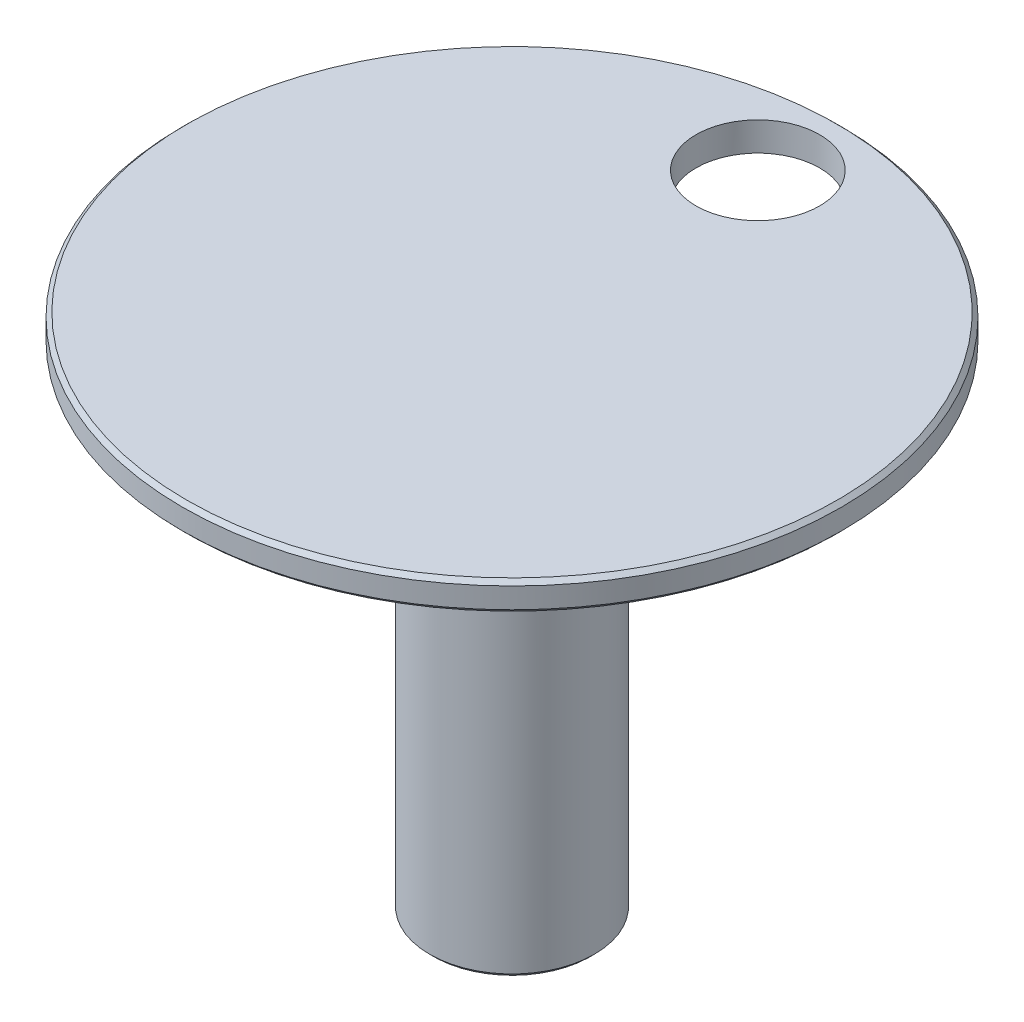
from build123d import *

# Parameters (mm, degrees)
SKETCH2_R          = 1.5
CUT_EXTRUDE1_DEPTH = 10
SKETCH3_R          = 1.5
CUT_EXTRUDE2_DEPTH = 8.5
CHAMFER1_SIZE      = 0.1


with BuildPart() as part:
    # Sketch1 → Revolve1 (revolve)
    with BuildSketch(Plane.XY, mode=Mode.PRIVATE) as revolve1_sk:
        Polygon((0, 7.486338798), (-8, 7.486338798), (-8, 6.786338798), (-4, 6.786338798), (-4, 6.486338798), (-2, 6.486338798), (-2, -5.113661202), (0, -5.113661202), align=None)
    revolve(revolve1_sk.sketch.rotate(Axis((0, 0, 0), (0, -1, 0)), 270), axis=Axis((0, 0, 0), (0, -1, 0)))

    # Sketch2 → Cut-Extrude1 (cut)
    with BuildSketch(Plane(origin=(0, 7.486338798, 0), x_dir=(1, 0, 0), z_dir=(0, 1, 0))):
        with Locations(Location((0, 5.968750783, 0), (0, 0, 270))):
            Circle(SKETCH2_R)
    extrude(amount=-CUT_EXTRUDE1_DEPTH, mode=Mode.SUBTRACT)

    # Sketch3 → Cut-Extrude2 (cut)
    with BuildSketch(Plane.XZ.offset(5.113661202)):
        with Locations(Location((0, 0, 0), (0, 0, 270))):
            Circle(SKETCH3_R)
    extrude(amount=-CUT_EXTRUDE2_DEPTH, mode=Mode.SUBTRACT)

    # Chamfer1
    chamfer1_edges = [part.edges().sort_by_distance(p)[0] for p in [
        (0, -5.113661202, -2),
        (0, 6.786338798, -8),
        (0, 7.486338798, -8),
    ]]
    chamfer(chamfer1_edges, length=CHAMFER1_SIZE)


solid = part.part
